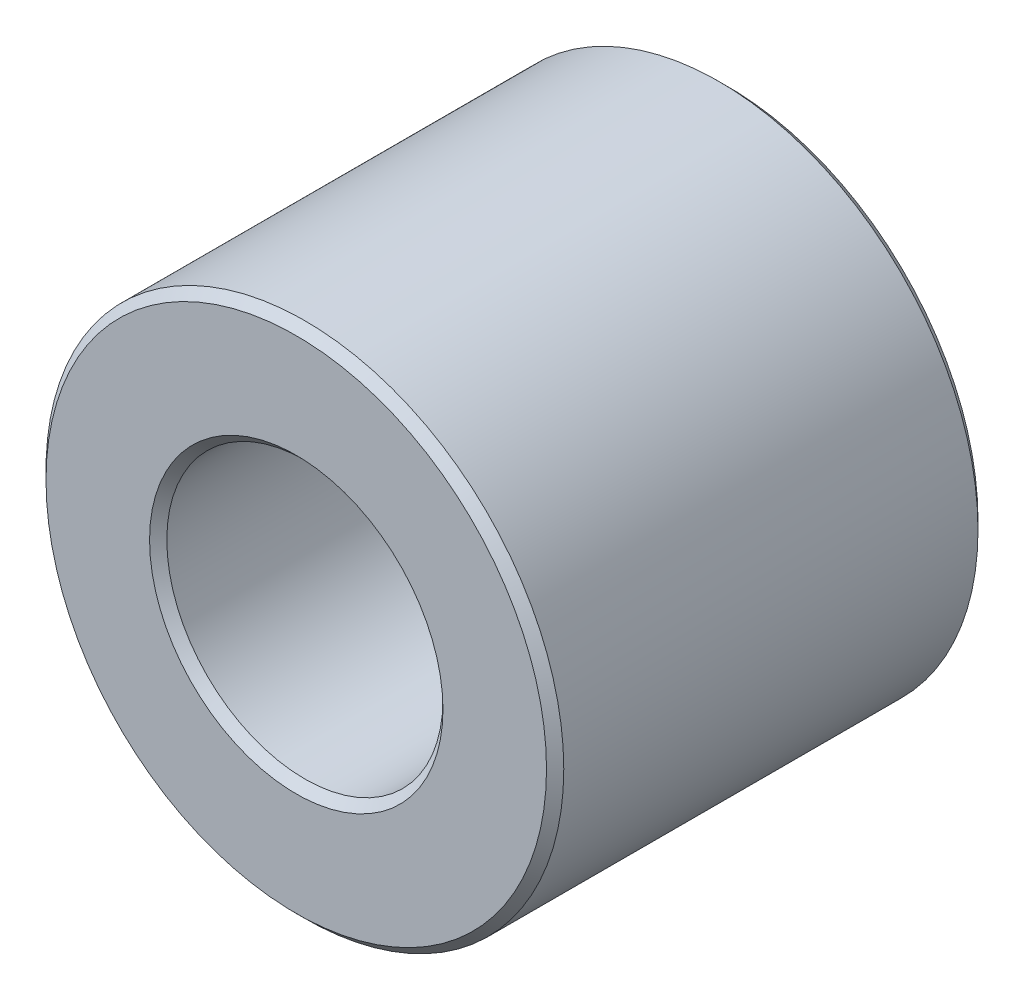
from build123d import *

# Parameters (mm, degrees)
SKETCH1_R           = 3
SKETCH1_R_2         = 1.6
BOSS_EXTRUDE2_DEPTH = 2.5
CHAMFER3_SIZE       = 0.1


with BuildPart() as part:
    # Sketch1 → Boss-Extrude2 (new, symmetric)
    with BuildSketch(Plane.XY):
        Circle(SKETCH1_R)
        Circle(SKETCH1_R_2, mode=Mode.SUBTRACT)
    extrude(amount=BOSS_EXTRUDE2_DEPTH, both=True)

    # Chamfer3
    chamfer3_edges = [part.edges().sort_by_distance(p)[0] for p in [
        (-3, 0, -2.5),
        (-3, 0, 2.5),
        (-1.6, 0, -2.5),
        (-1.6, 0, 2.5),
    ]]
    chamfer(chamfer3_edges, length=CHAMFER3_SIZE)


solid = part.part
